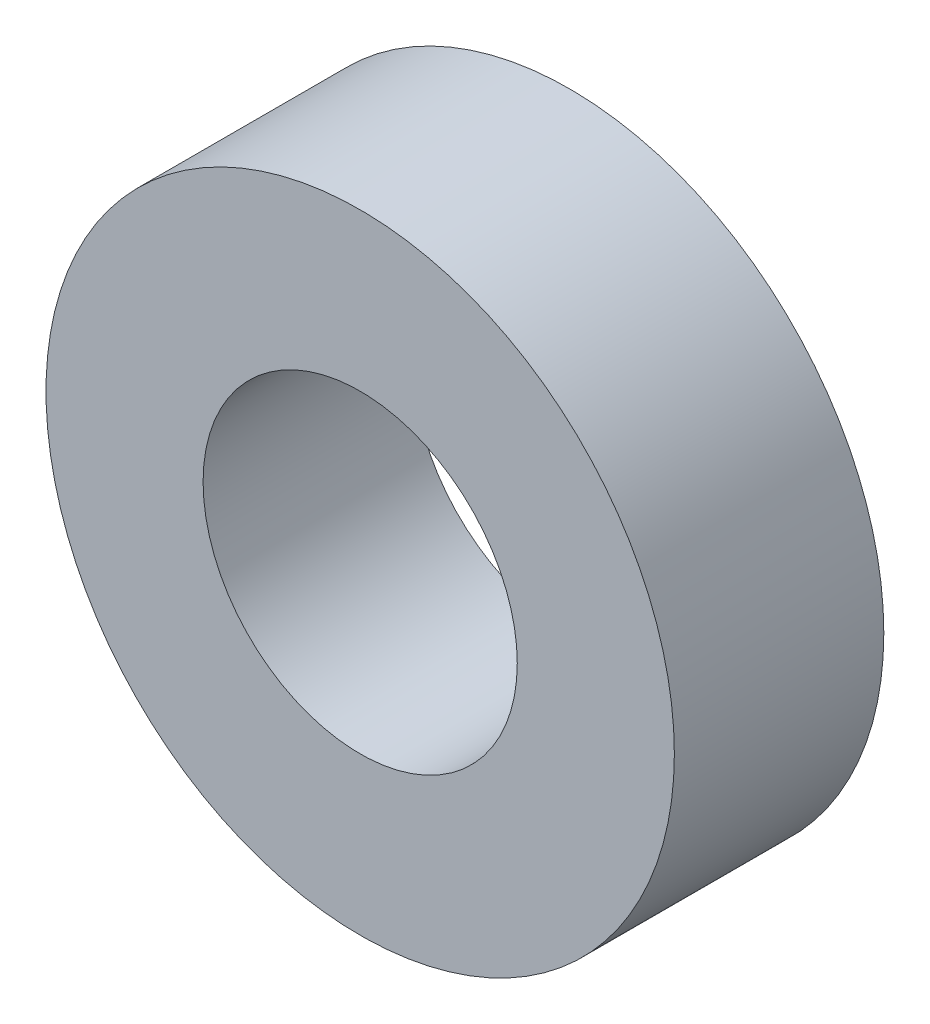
from build123d import *

# Parameters (mm, degrees)
ESQUISSE1_R      = 15
ESQUISSE1_R_2    = 7.5
EXTRUSION1_DEPTH = 10


with BuildPart() as part:
    # Esquisse1 → Extrusion1 (new body)
    with BuildSketch(Plane.XY):
        Circle(ESQUISSE1_R)
        Circle(ESQUISSE1_R_2, mode=Mode.SUBTRACT)
    extrude(amount=EXTRUSION1_DEPTH)


solid = part.part
